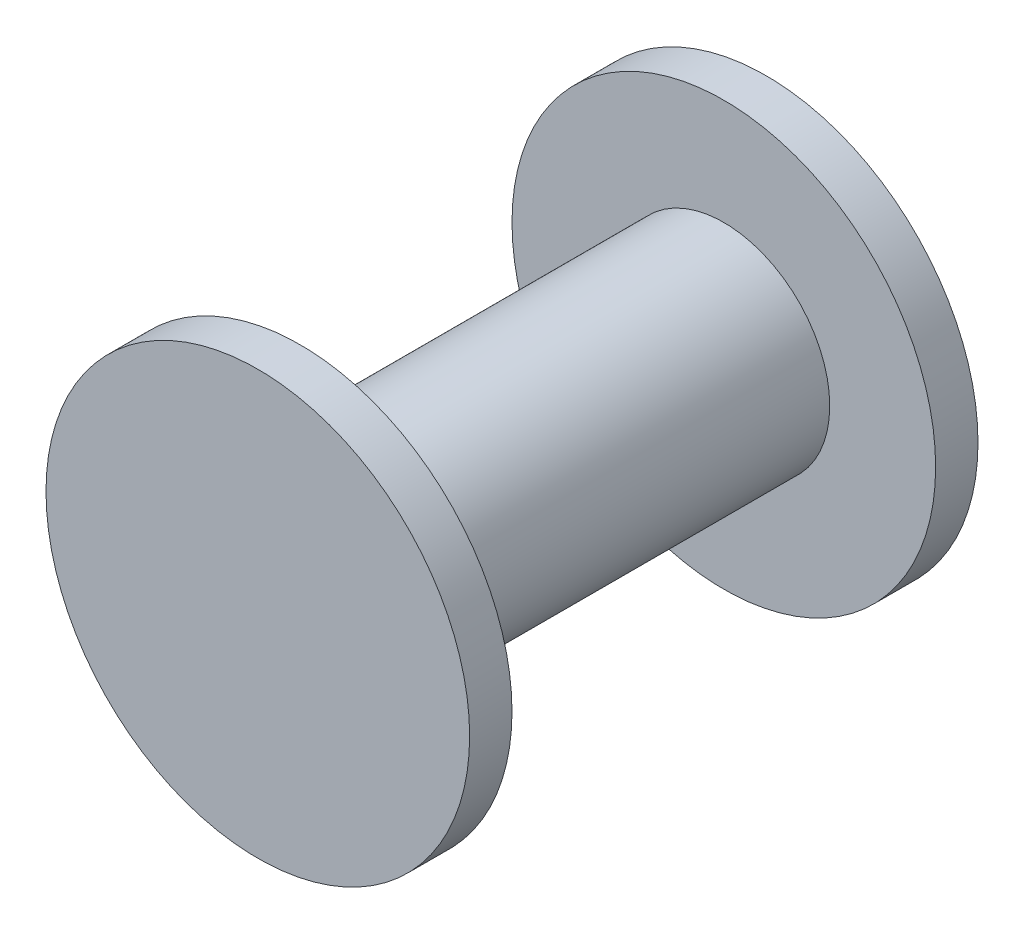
ISO-10303-21;
HEADER;
FILE_DESCRIPTION(('STEP AP214'),'2;1');
FILE_NAME('part.step','',(''),(''),'','','');
FILE_SCHEMA(('AUTOMOTIVE_DESIGN { 1 0 10303 214 1 1 1 1 }'));
ENDSEC;
DATA;
#1=APPLICATION_CONTEXT('core data for automotive mechanical design processes');
#2=APPLICATION_PROTOCOL_DEFINITION('international standard','automotive_design',2000,#1);
#3=PRODUCT_CONTEXT('',#1,'mechanical');
#4=PRODUCT('Part','Part','',(#3));
#5=PRODUCT_RELATED_PRODUCT_CATEGORY('part','',(#4));
#6=PRODUCT_DEFINITION_FORMATION('','',#4);
#7=PRODUCT_DEFINITION_CONTEXT('part definition',#1,'design');
#8=PRODUCT_DEFINITION('design','',#6,#7);
#9=PRODUCT_DEFINITION_SHAPE('','',#8);
#10=(LENGTH_UNIT() NAMED_UNIT(*) SI_UNIT(.MILLI.,.METRE.));
#11=(NAMED_UNIT(*) PLANE_ANGLE_UNIT() SI_UNIT($,.RADIAN.));
#12=(NAMED_UNIT(*) SI_UNIT($,.STERADIAN.) SOLID_ANGLE_UNIT());
#13=UNCERTAINTY_MEASURE_WITH_UNIT(LENGTH_MEASURE(1.E-05),#10,'distance_accuracy_value','');
#14=(GEOMETRIC_REPRESENTATION_CONTEXT(3) GLOBAL_UNCERTAINTY_ASSIGNED_CONTEXT((#13)) GLOBAL_UNIT_ASSIGNED_CONTEXT((#10,
#11,#12)) REPRESENTATION_CONTEXT('',''));
#15=CARTESIAN_POINT('',(0.,0.,0.));
#16=DIRECTION('',(0.,0.,1.));
#17=DIRECTION('',(1.,0.,0.));
#18=AXIS2_PLACEMENT_3D('',#15,#16,#17);
#19=CARTESIAN_POINT('',(0.,0.,-24.));
#20=DIRECTION('',(0.,0.,1.));
#21=DIRECTION('',(1.,0.,0.));
#22=AXIS2_PLACEMENT_3D('',#19,#20,#21);
#23=CYLINDRICAL_SURFACE('',#22,20.);
#24=CARTESIAN_POINT('',(0.,0.,-24.));
#25=DIRECTION('',(0.,0.,1.));
#26=DIRECTION('',(1.,0.,0.));
#27=AXIS2_PLACEMENT_3D('',#24,#25,#26);
#28=CIRCLE('',#27,20.);
#29=CARTESIAN_POINT('',(20.,0.,-24.));
#30=VERTEX_POINT('',#29);
#31=EDGE_CURVE('E10',#30,#30,#28,.T.);
#32=ORIENTED_EDGE('',*,*,#31,.T.);
#33=EDGE_LOOP('',(#32));
#34=FACE_BOUND('',#33,.T.);
#35=CARTESIAN_POINT('',(0.,0.,-20.));
#36=DIRECTION('',(0.,0.,1.));
#37=DIRECTION('',(1.,0.,0.));
#38=AXIS2_PLACEMENT_3D('',#35,#36,#37);
#39=CIRCLE('',#38,20.);
#40=CARTESIAN_POINT('',(20.,0.,-20.));
#41=VERTEX_POINT('',#40);
#42=EDGE_CURVE('E50',#41,#41,#39,.T.);
#43=ORIENTED_EDGE('',*,*,#42,.F.);
#44=EDGE_LOOP('',(#43));
#45=FACE_BOUND('',#44,.T.);
#46=ADVANCED_FACE('F39',(#34,#45),#23,.T.);
#47=CARTESIAN_POINT('',(0.,0.,-24.));
#48=DIRECTION('',(0.,0.,1.));
#49=DIRECTION('',(1.,0.,0.));
#50=AXIS2_PLACEMENT_3D('',#47,#48,#49);
#51=PLANE('',#50);
#52=ORIENTED_EDGE('',*,*,#31,.F.);
#53=EDGE_LOOP('',(#52));
#54=FACE_BOUND('',#53,.T.);
#55=ADVANCED_FACE('F71',(#54),#51,.F.);
#56=CARTESIAN_POINT('',(0.,0.,-20.));
#57=DIRECTION('',(0.,0.,1.));
#58=DIRECTION('',(1.,0.,0.));
#59=AXIS2_PLACEMENT_3D('',#56,#57,#58);
#60=PLANE('',#59);
#61=CARTESIAN_POINT('',(0.,0.,-20.));
#62=DIRECTION('',(0.,0.,1.));
#63=DIRECTION('',(1.,0.,0.));
#64=AXIS2_PLACEMENT_3D('',#61,#62,#63);
#65=CIRCLE('',#64,10.);
#66=CARTESIAN_POINT('',(10.,0.,-20.));
#67=VERTEX_POINT('',#66);
#68=EDGE_CURVE('E55',#67,#67,#65,.T.);
#69=ORIENTED_EDGE('',*,*,#68,.F.);
#70=EDGE_LOOP('',(#69));
#71=FACE_BOUND('',#70,.T.);
#72=ORIENTED_EDGE('',*,*,#42,.T.);
#73=EDGE_LOOP('',(#72));
#74=FACE_BOUND('',#73,.T.);
#75=ADVANCED_FACE('F67',(#71,#74),#60,.T.);
#76=CARTESIAN_POINT('',(0.,0.,20.));
#77=DIRECTION('',(0.,0.,1.));
#78=DIRECTION('',(1.,0.,0.));
#79=AXIS2_PLACEMENT_3D('',#76,#77,#78);
#80=PLANE('',#79);
#81=CARTESIAN_POINT('',(0.,0.,20.));
#82=DIRECTION('',(0.,0.,1.));
#83=DIRECTION('',(1.,0.,0.));
#84=AXIS2_PLACEMENT_3D('',#81,#82,#83);
#85=CIRCLE('',#84,10.);
#86=CARTESIAN_POINT('',(10.,0.,20.));
#87=VERTEX_POINT('',#86);
#88=EDGE_CURVE('E58',#87,#87,#85,.T.);
#89=ORIENTED_EDGE('',*,*,#88,.T.);
#90=EDGE_LOOP('',(#89));
#91=FACE_BOUND('',#90,.T.);
#92=CARTESIAN_POINT('',(0.,0.,20.));
#93=DIRECTION('',(0.,0.,1.));
#94=DIRECTION('',(1.,0.,0.));
#95=AXIS2_PLACEMENT_3D('',#92,#93,#94);
#96=CIRCLE('',#95,20.);
#97=CARTESIAN_POINT('',(20.,0.,20.));
#98=VERTEX_POINT('',#97);
#99=EDGE_CURVE('E52',#98,#98,#96,.T.);
#100=ORIENTED_EDGE('',*,*,#99,.F.);
#101=EDGE_LOOP('',(#100));
#102=FACE_BOUND('',#101,.T.);
#103=ADVANCED_FACE('F70',(#91,#102),#80,.F.);
#104=CARTESIAN_POINT('',(0.,0.,-20.));
#105=DIRECTION('',(0.,0.,1.));
#106=DIRECTION('',(1.,0.,0.));
#107=AXIS2_PLACEMENT_3D('',#104,#105,#106);
#108=CYLINDRICAL_SURFACE('',#107,10.);
#109=ORIENTED_EDGE('',*,*,#68,.T.);
#110=EDGE_LOOP('',(#109));
#111=FACE_BOUND('',#110,.T.);
#112=ORIENTED_EDGE('',*,*,#88,.F.);
#113=EDGE_LOOP('',(#112));
#114=FACE_BOUND('',#113,.T.);
#115=ADVANCED_FACE('F64',(#111,#114),#108,.T.);
#116=CARTESIAN_POINT('',(0.,0.,24.));
#117=DIRECTION('',(0.,0.,1.));
#118=DIRECTION('',(1.,0.,0.));
#119=AXIS2_PLACEMENT_3D('',#116,#117,#118);
#120=PLANE('',#119);
#121=CARTESIAN_POINT('',(0.,0.,24.));
#122=DIRECTION('',(0.,0.,1.));
#123=DIRECTION('',(1.,0.,0.));
#124=AXIS2_PLACEMENT_3D('',#121,#122,#123);
#125=CIRCLE('',#124,20.);
#126=CARTESIAN_POINT('',(20.,0.,24.));
#127=VERTEX_POINT('',#126);
#128=EDGE_CURVE('E43',#127,#127,#125,.T.);
#129=ORIENTED_EDGE('',*,*,#128,.T.);
#130=EDGE_LOOP('',(#129));
#131=FACE_BOUND('',#130,.T.);
#132=ADVANCED_FACE('F83',(#131),#120,.T.);
#133=ORIENTED_EDGE('',*,*,#99,.T.);
#134=EDGE_LOOP('',(#133));
#135=FACE_BOUND('',#134,.T.);
#136=ORIENTED_EDGE('',*,*,#128,.F.);
#137=EDGE_LOOP('',(#136));
#138=FACE_BOUND('',#137,.T.);
#139=ADVANCED_FACE('F41',(#135,#138),#23,.T.);
#140=CLOSED_SHELL('',(#46,#55,#75,#103,#115,#132,#139));
#141=MANIFOLD_SOLID_BREP('B2',#140);
#142=ADVANCED_BREP_SHAPE_REPRESENTATION('',(#18,#141),#14);
#143=SHAPE_DEFINITION_REPRESENTATION(#9,#142);
ENDSEC;
END-ISO-10303-21;
